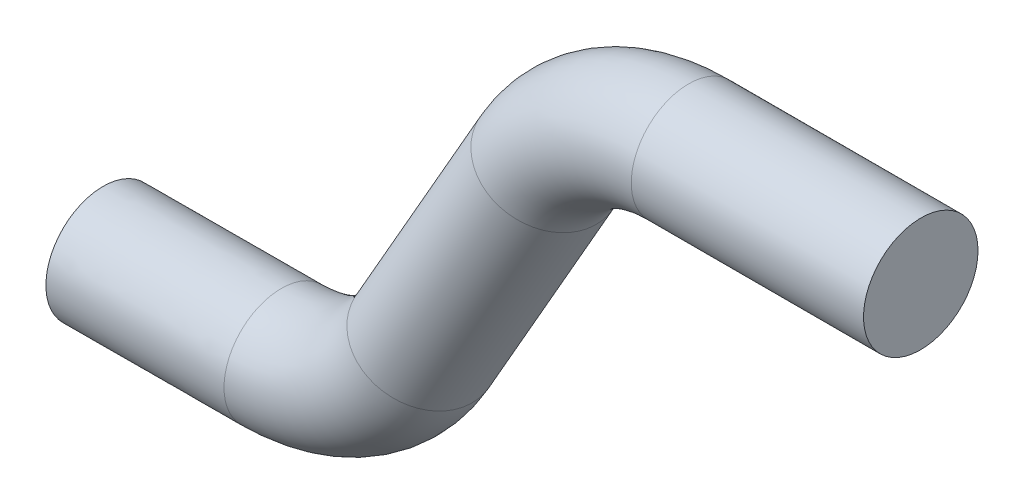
from build123d import *

# Parameters (mm, degrees)
ESQUISSE3_R             = 5.25
ESQUISSE5_R             = 1
ENL_V_MAT_EXTRU_1_DEPTH = 10


with BuildPart() as part:
    # Balayage1: sweep along a path in Esquisse2
    with BuildLine(Plane.XY) as balayage1_path:
        Line((0, 0), (16.3372746, 0.052463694))
        ThreePointArc((16.3372746, 0.052463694), (23.832413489, 2.087105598), (29.305380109, 7.59741512))
        Line((29.305380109, 7.59741512), (40.678642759, 27.454971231))
        ThreePointArc((40.678642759, 27.454971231), (46.172436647, 32.977375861), (53.694917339, 35))
        Line((53.694917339, 35), (75, 35))
    # Esquisse3 → Balayage1 (sweep)
    with BuildSketch(Plane(origin=(0, 0, 0), x_dir=(0, 0, -1), z_dir=(1, 0, 0))):
        Circle(ESQUISSE3_R)
    sweep(path=balayage1_path.line)

    # Esquisse5 → Enl_v. mat.-Extru.1 (cut)
    with BuildSketch(Plane(origin=(0, 0, 0), x_dir=(1, 0, 0), z_dir=(0, 1, 0))):
        with Locations(Location((8, 0, 0), (0, 0, 270))):
            Circle(ESQUISSE5_R)
    extrude(amount=-ENL_V_MAT_EXTRU_1_DEPTH, mode=Mode.SUBTRACT)


solid = part.part
